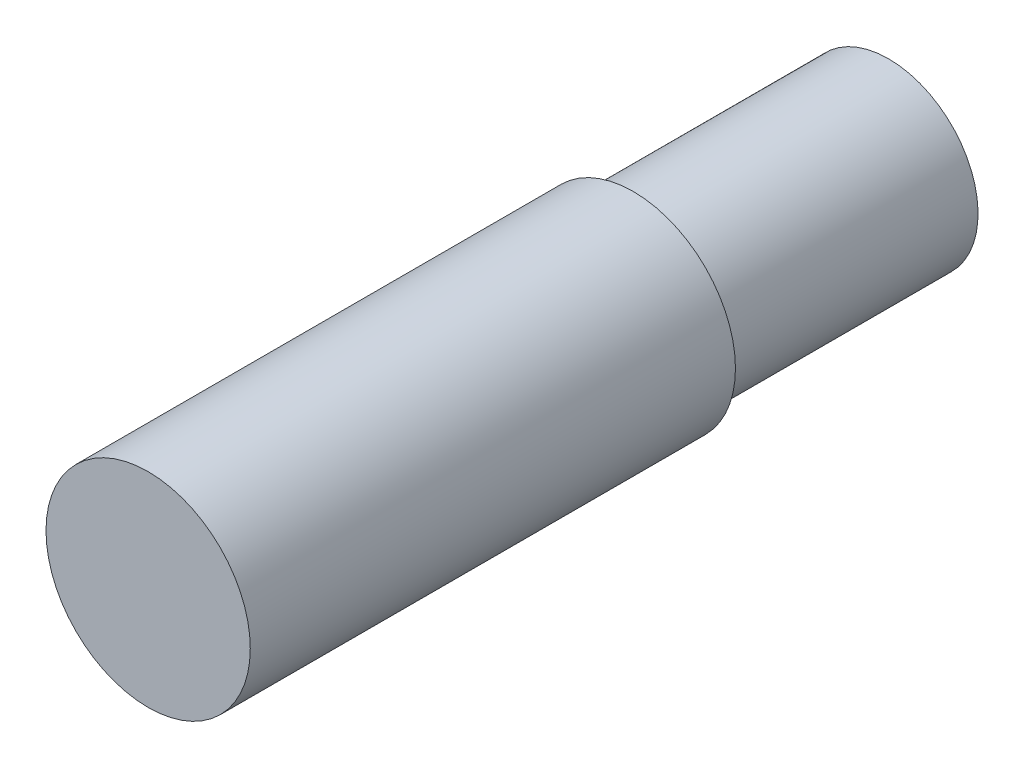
from build123d import *


with BuildPart() as part:
    # Sketch1 → Revolve1 (revolve)
    with BuildSketch(Plane(origin=(0, 0, 0), x_dir=(0, 0, -1), z_dir=(1, 0, 0))):
        Polygon((0, 0), (0, 25.4), (120.65, 25.4), (120.65, 22.225), (184.15, 22.225), (184.15, 0), align=None)
    revolve(axis=Axis((0, 0, -184.15), (0, 0, 1)))

    # Sketch2 → Revolve2 (revolve)
    with BuildSketch(Plane(origin=(0, 0, 0), x_dir=(0, 0, -1), z_dir=(1, 0, 0))):
        with BuildLine():
            Line((184.15, 0), (188.8998, 0))
            ThreePointArc((188.8998, 0), (187.699092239, 11.363441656), (184.15, 22.225))
            Line((184.15, 22.225), (184.15, 0))
        make_face()
    revolve(axis=Axis((0, 0, -184.15), (0, 0, -1)))


solid = part.part
